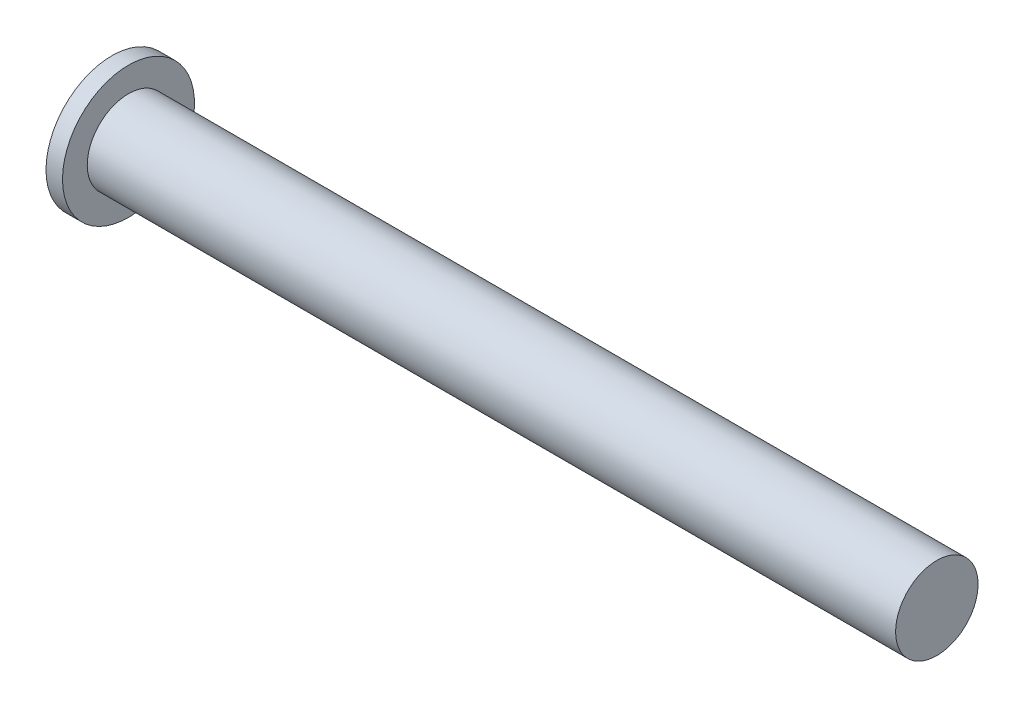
ISO-10303-21;
HEADER;
FILE_DESCRIPTION(('STEP AP214'),'2;1');
FILE_NAME('part.step','',(''),(''),'','','');
FILE_SCHEMA(('AUTOMOTIVE_DESIGN { 1 0 10303 214 1 1 1 1 }'));
ENDSEC;
DATA;
#1=APPLICATION_CONTEXT('core data for automotive mechanical design processes');
#2=APPLICATION_PROTOCOL_DEFINITION('international standard','automotive_design',2000,#1);
#3=PRODUCT_CONTEXT('',#1,'mechanical');
#4=PRODUCT('Part','Part','',(#3));
#5=PRODUCT_RELATED_PRODUCT_CATEGORY('part','',(#4));
#6=PRODUCT_DEFINITION_FORMATION('','',#4);
#7=PRODUCT_DEFINITION_CONTEXT('part definition',#1,'design');
#8=PRODUCT_DEFINITION('design','',#6,#7);
#9=PRODUCT_DEFINITION_SHAPE('','',#8);
#10=(LENGTH_UNIT() NAMED_UNIT(*) SI_UNIT(.MILLI.,.METRE.));
#11=(NAMED_UNIT(*) PLANE_ANGLE_UNIT() SI_UNIT($,.RADIAN.));
#12=(NAMED_UNIT(*) SI_UNIT($,.STERADIAN.) SOLID_ANGLE_UNIT());
#13=UNCERTAINTY_MEASURE_WITH_UNIT(LENGTH_MEASURE(1.E-05),#10,'distance_accuracy_value','');
#14=(GEOMETRIC_REPRESENTATION_CONTEXT(3) GLOBAL_UNCERTAINTY_ASSIGNED_CONTEXT((#13)) GLOBAL_UNIT_ASSIGNED_CONTEXT((#10,
#11,#12)) REPRESENTATION_CONTEXT('',''));
#15=CARTESIAN_POINT('',(0.,0.,0.));
#16=DIRECTION('',(0.,0.,1.));
#17=DIRECTION('',(1.,0.,0.));
#18=AXIS2_PLACEMENT_3D('',#15,#16,#17);
#19=CARTESIAN_POINT('',(0.,0.,0.));
#20=DIRECTION('',(1.,0.,0.));
#21=DIRECTION('',(0.,0.,-1.));
#22=AXIS2_PLACEMENT_3D('',#19,#20,#21);
#23=PLANE('',#22);
#24=CARTESIAN_POINT('',(0.,0.,0.));
#25=DIRECTION('',(-1.,0.,0.));
#26=DIRECTION('',(0.,0.,1.));
#27=AXIS2_PLACEMENT_3D('',#24,#25,#26);
#28=CIRCLE('',#27,4.8768);
#29=CARTESIAN_POINT('',(0.,0.,4.8768));
#30=VERTEX_POINT('',#29);
#31=EDGE_CURVE('E10',#30,#30,#28,.T.);
#32=ORIENTED_EDGE('',*,*,#31,.T.);
#33=EDGE_LOOP('',(#32));
#34=FACE_BOUND('',#33,.T.);
#35=ADVANCED_FACE('F30',(#34),#23,.F.);
#36=CARTESIAN_POINT('',(60.96,0.,0.));
#37=DIRECTION('',(-1.,0.,0.));
#38=DIRECTION('',(0.,0.,1.));
#39=AXIS2_PLACEMENT_3D('',#36,#37,#38);
#40=CYLINDRICAL_SURFACE('',#39,4.8768);
#41=ORIENTED_EDGE('',*,*,#31,.F.);
#42=EDGE_LOOP('',(#41));
#43=FACE_BOUND('',#42,.T.);
#44=CARTESIAN_POINT('',(1.2192,0.,0.));
#45=DIRECTION('',(-1.,0.,0.));
#46=DIRECTION('',(0.,0.,1.));
#47=AXIS2_PLACEMENT_3D('',#44,#45,#46);
#48=CIRCLE('',#47,4.8768);
#49=CARTESIAN_POINT('',(1.2192,0.,4.8768));
#50=VERTEX_POINT('',#49);
#51=EDGE_CURVE('E36',#50,#50,#48,.T.);
#52=ORIENTED_EDGE('',*,*,#51,.T.);
#53=EDGE_LOOP('',(#52));
#54=FACE_BOUND('',#53,.T.);
#55=ADVANCED_FACE('F62',(#43,#54),#40,.T.);
#56=CARTESIAN_POINT('',(1.2192,4.8768,0.));
#57=DIRECTION('',(-1.,0.,0.));
#58=DIRECTION('',(0.,0.,1.));
#59=AXIS2_PLACEMENT_3D('',#56,#57,#58);
#60=PLANE('',#59);
#61=ORIENTED_EDGE('',*,*,#51,.F.);
#62=EDGE_LOOP('',(#61));
#63=FACE_BOUND('',#62,.T.);
#64=CARTESIAN_POINT('',(1.2192,0.,0.));
#65=DIRECTION('',(-1.,0.,0.));
#66=DIRECTION('',(0.,0.,1.));
#67=AXIS2_PLACEMENT_3D('',#64,#65,#66);
#68=CIRCLE('',#67,3.048);
#69=CARTESIAN_POINT('',(1.2192,0.,3.048));
#70=VERTEX_POINT('',#69);
#71=EDGE_CURVE('E40',#70,#70,#68,.T.);
#72=ORIENTED_EDGE('',*,*,#71,.T.);
#73=EDGE_LOOP('',(#72));
#74=FACE_BOUND('',#73,.T.);
#75=ADVANCED_FACE('F58',(#63,#74),#60,.F.);
#76=CARTESIAN_POINT('',(60.96,0.,0.));
#77=DIRECTION('',(-1.,0.,0.));
#78=DIRECTION('',(0.,0.,1.));
#79=AXIS2_PLACEMENT_3D('',#76,#77,#78);
#80=CYLINDRICAL_SURFACE('',#79,3.048);
#81=ORIENTED_EDGE('',*,*,#71,.F.);
#82=EDGE_LOOP('',(#81));
#83=FACE_BOUND('',#82,.T.);
#84=CARTESIAN_POINT('',(60.96,0.,0.));
#85=DIRECTION('',(-1.,0.,0.));
#86=DIRECTION('',(0.,0.,1.));
#87=AXIS2_PLACEMENT_3D('',#84,#85,#86);
#88=CIRCLE('',#87,3.048);
#89=CARTESIAN_POINT('',(60.96,0.,3.048));
#90=VERTEX_POINT('',#89);
#91=EDGE_CURVE('E44',#90,#90,#88,.T.);
#92=ORIENTED_EDGE('',*,*,#91,.T.);
#93=EDGE_LOOP('',(#92));
#94=FACE_BOUND('',#93,.T.);
#95=ADVANCED_FACE('F50',(#83,#94),#80,.T.);
#96=CARTESIAN_POINT('',(60.96,3.048,0.));
#97=DIRECTION('',(-1.,0.,0.));
#98=DIRECTION('',(0.,0.,1.));
#99=AXIS2_PLACEMENT_3D('',#96,#97,#98);
#100=PLANE('',#99);
#101=ORIENTED_EDGE('',*,*,#91,.F.);
#102=EDGE_LOOP('',(#101));
#103=FACE_BOUND('',#102,.T.);
#104=ADVANCED_FACE('F52',(#103),#100,.F.);
#105=CLOSED_SHELL('',(#35,#55,#75,#95,#104));
#106=MANIFOLD_SOLID_BREP('B2',#105);
#107=ADVANCED_BREP_SHAPE_REPRESENTATION('',(#18,#106),#14);
#108=SHAPE_DEFINITION_REPRESENTATION(#9,#107);
ENDSEC;
END-ISO-10303-21;
